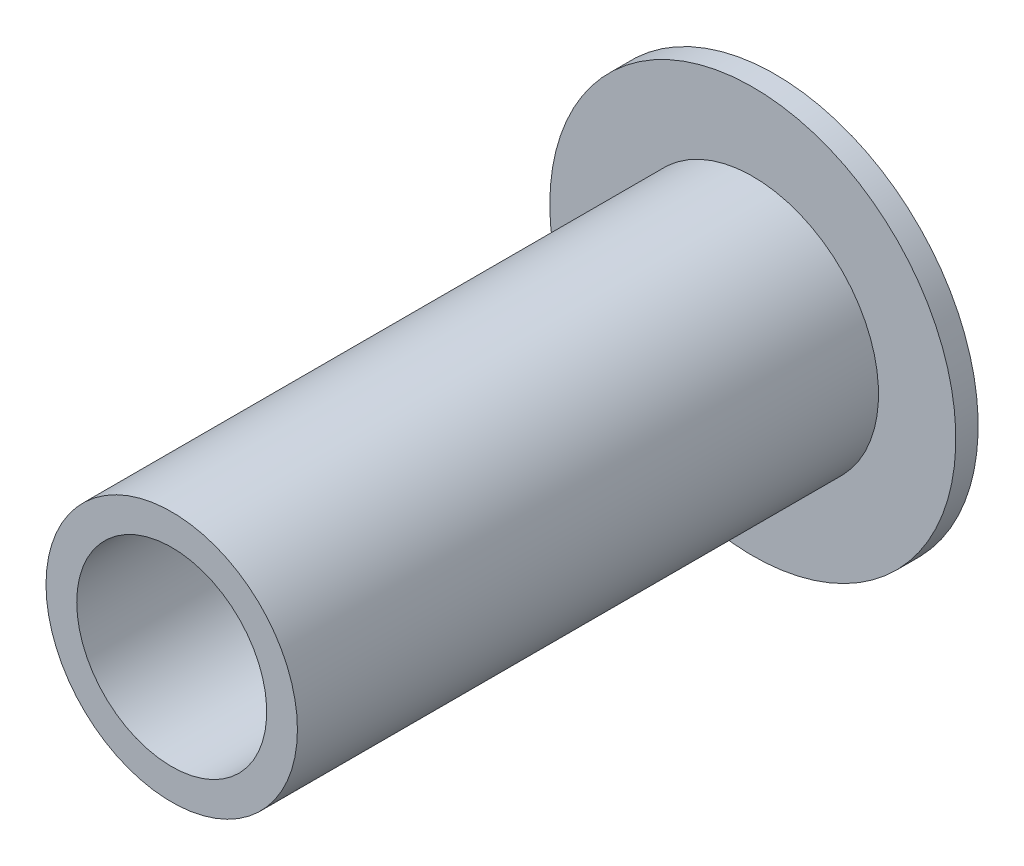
from build123d import *

# Parameters (mm, degrees)
ESQUISSE1_R             = 3.375
BASE_EXTRUSION_DEPTH    = 15.6
ESQUISSE2_R             = 5.45
BOSS_EXTRU_1_DEPTH      = 0.6
ESQUISSE3_R             = 3.5
BOSS_EXTRU_2_DEPTH      = 1
ESQUISSE4_R             = 2.55
ENL_V_MAT_EXTRU_1_DEPTH = 19.847944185
CHANFREIN1_SIZE         = 0.6


with BuildPart() as part:
    # Esquisse1 → Base-Extrusion (new body)
    with BuildSketch(Plane.XY):
        with Locations(Location((0, 0, 0), (0, 0, 180))):
            Circle(ESQUISSE1_R)
    extrude(amount=BASE_EXTRUSION_DEPTH)

    # Esquisse2 → Boss.-Extru.1 (add)
    with BuildSketch(Plane(origin=(0, 0, 0), x_dir=(-1, 0, 0), z_dir=(0, 0, -1))):
        Circle(ESQUISSE2_R)
    extrude(amount=BOSS_EXTRU_1_DEPTH)

    # Esquisse3 → Boss.-Extru.2 (add)
    with BuildSketch(Plane(origin=(0, 0, -0.6), x_dir=(-1, 0, 0), z_dir=(0, 0, -1))):
        Circle(ESQUISSE3_R)
    extrude(amount=BOSS_EXTRU_2_DEPTH)

    # Esquisse4 → Enl_v. mat.-Extru.1 (cut, through all)
    with BuildSketch(Plane(origin=(0, 0, -1.6), x_dir=(-1, 0, 0), z_dir=(0, 0, -1))):
        Circle(ESQUISSE4_R)
    extrude(amount=-ENL_V_MAT_EXTRU_1_DEPTH, mode=Mode.SUBTRACT)

    # Chanfrein1
    chanfrein1_edges = [part.edges().sort_by_distance(p)[0] for p in [
        (3.5, 0, -1.6),
    ]]
    chamfer(chanfrein1_edges, length=CHANFREIN1_SIZE)


solid = part.part
